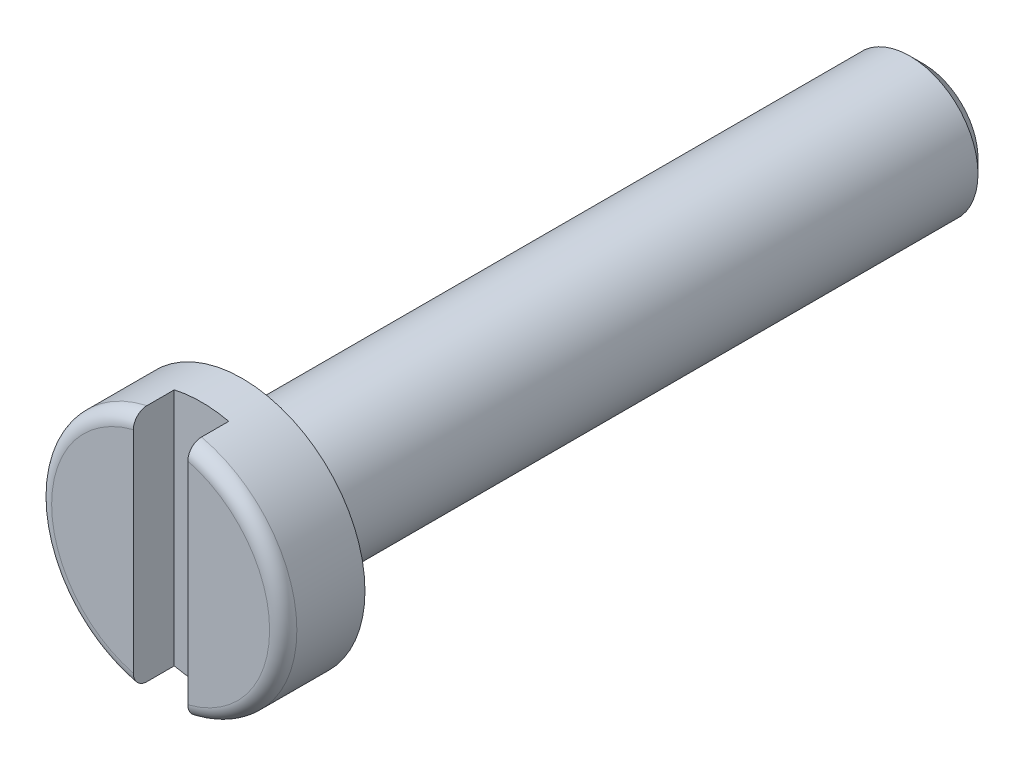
ISO-10303-21;
HEADER;
FILE_DESCRIPTION(('STEP AP214'),'2;1');
FILE_NAME('part.step','',(''),(''),'','','');
FILE_SCHEMA(('AUTOMOTIVE_DESIGN { 1 0 10303 214 1 1 1 1 }'));
ENDSEC;
DATA;
#1=APPLICATION_CONTEXT('core data for automotive mechanical design processes');
#2=APPLICATION_PROTOCOL_DEFINITION('international standard','automotive_design',2000,#1);
#3=PRODUCT_CONTEXT('',#1,'mechanical');
#4=PRODUCT('Part','Part','',(#3));
#5=PRODUCT_RELATED_PRODUCT_CATEGORY('part','',(#4));
#6=PRODUCT_DEFINITION_FORMATION('','',#4);
#7=PRODUCT_DEFINITION_CONTEXT('part definition',#1,'design');
#8=PRODUCT_DEFINITION('design','',#6,#7);
#9=PRODUCT_DEFINITION_SHAPE('','',#8);
#10=(LENGTH_UNIT() NAMED_UNIT(*) SI_UNIT(.MILLI.,.METRE.));
#11=(NAMED_UNIT(*) PLANE_ANGLE_UNIT() SI_UNIT($,.RADIAN.));
#12=(NAMED_UNIT(*) SI_UNIT($,.STERADIAN.) SOLID_ANGLE_UNIT());
#13=UNCERTAINTY_MEASURE_WITH_UNIT(LENGTH_MEASURE(1.E-05),#10,'distance_accuracy_value','');
#14=(GEOMETRIC_REPRESENTATION_CONTEXT(3) GLOBAL_UNCERTAINTY_ASSIGNED_CONTEXT((#13)) GLOBAL_UNIT_ASSIGNED_CONTEXT((#10,
#11,#12)) REPRESENTATION_CONTEXT('',''));
#15=CARTESIAN_POINT('',(0.,0.,0.));
#16=DIRECTION('',(0.,0.,1.));
#17=DIRECTION('',(1.,0.,0.));
#18=AXIS2_PLACEMENT_3D('',#15,#16,#17);
#19=CARTESIAN_POINT('',(0.,0.,3.));
#20=DIRECTION('',(0.,0.,1.));
#21=DIRECTION('',(1.,0.,0.));
#22=AXIS2_PLACEMENT_3D('',#19,#20,#21);
#23=PLANE('',#22);
#24=DIRECTION('',(0.,-1.,0.));
#25=VECTOR('',#24,1.);
#26=CARTESIAN_POINT('',(-1.,4.8446694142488,3.));
#27=LINE('',#26,#25);
#28=CARTESIAN_POINT('',(-1.,3.87298334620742,3.));
#29=VERTEX_POINT('',#28);
#30=CARTESIAN_POINT('',(-1.,-3.87298334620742,3.));
#31=VERTEX_POINT('',#30);
#32=EDGE_CURVE('E88',#29,#31,#27,.T.);
#33=ORIENTED_EDGE('',*,*,#32,.F.);
#34=CARTESIAN_POINT('',(0.,0.,3.));
#35=DIRECTION('',(0.,0.,1.));
#36=DIRECTION('',(1.,0.,0.));
#37=AXIS2_PLACEMENT_3D('',#34,#35,#36);
#38=CIRCLE('',#37,4.);
#39=EDGE_CURVE('E99',#29,#31,#38,.T.);
#40=ORIENTED_EDGE('',*,*,#39,.T.);
#41=EDGE_LOOP('',(#33,#40));
#42=FACE_BOUND('',#41,.T.);
#43=ADVANCED_FACE('F33',(#42),#23,.T.);
#44=CARTESIAN_POINT('',(0.,0.,2.5));
#45=DIRECTION('',(0.,0.,1.));
#46=DIRECTION('',(1.,0.,0.));
#47=AXIS2_PLACEMENT_3D('',#44,#45,#46);
#48=TOROIDAL_SURFACE('',#47,4.,0.5);
#49=CARTESIAN_POINT('',(-0.999999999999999,-4.32830289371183,2.73313755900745));
#50=CARTESIAN_POINT('',(-0.999999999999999,-4.34139692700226,2.70893011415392));
#51=CARTESIAN_POINT('',(-0.999999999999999,-4.35247607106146,2.68361258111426));
#52=CARTESIAN_POINT('',(-0.999999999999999,-4.37024206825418,2.63145979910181));
#53=CARTESIAN_POINT('',(-0.999999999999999,-4.3769246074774,2.60462308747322));
#54=CARTESIAN_POINT('',(-0.999999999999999,-4.38567140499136,2.55020578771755));
#55=CARTESIAN_POINT('',(-0.999999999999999,-4.38773592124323,2.52262524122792));
#56=CARTESIAN_POINT('',(-0.999999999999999,-4.38717864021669,2.46751789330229));
#57=CARTESIAN_POINT('',(-0.999999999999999,-4.38455784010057,2.43999108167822));
#58=CARTESIAN_POINT('',(-0.999999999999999,-4.37474078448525,2.3859011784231));
#59=CARTESIAN_POINT('',(-0.999999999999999,-4.3675661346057,2.35933415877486));
#60=CARTESIAN_POINT('',(-0.999999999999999,-4.34888894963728,2.30776860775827));
#61=CARTESIAN_POINT('',(-0.999999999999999,-4.33738623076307,2.282770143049));
#62=CARTESIAN_POINT('',(-0.999999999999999,-4.31031223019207,2.23484839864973));
#63=CARTESIAN_POINT('',(-0.999999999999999,-4.29471242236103,2.21194124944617));
#64=CARTESIAN_POINT('',(-0.999999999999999,-4.25995757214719,2.16900704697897));
#65=CARTESIAN_POINT('',(-1.,-4.2408022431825,2.14898022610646));
#66=CARTESIAN_POINT('',(-1.,-4.19908637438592,2.11194360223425));
#67=CARTESIAN_POINT('',(-1.,-4.17646615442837,2.09500105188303));
#68=CARTESIAN_POINT('',(-1.,-4.12876331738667,2.06503880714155));
#69=CARTESIAN_POINT('',(-1.,-4.10368039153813,2.05201960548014));
#70=CARTESIAN_POINT('',(-1.,-4.0510522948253,2.02990560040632));
#71=CARTESIAN_POINT('',(-1.,-4.0234593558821,2.02092447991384));
#72=CARTESIAN_POINT('',(-1.,-3.96717619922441,2.00759679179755));
#73=CARTESIAN_POINT('',(-1.,-3.93848582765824,2.00325087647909));
#74=CARTESIAN_POINT('',(-1.,-3.88006131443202,1.9992227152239));
#75=CARTESIAN_POINT('',(-1.,-3.85031895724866,1.99965911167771));
#76=CARTESIAN_POINT('',(-1.,-3.79131568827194,2.00545202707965));
#77=CARTESIAN_POINT('',(-1.,-3.76205482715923,2.01080906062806));
#78=CARTESIAN_POINT('',(-1.,-3.70446791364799,2.02640202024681));
#79=CARTESIAN_POINT('',(-1.,-3.67615807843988,2.03669798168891));
#80=CARTESIAN_POINT('',(-1.,-3.6216883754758,2.06193749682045));
#81=CARTESIAN_POINT('',(-1.,-3.59552850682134,2.07688104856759));
#82=CARTESIAN_POINT('',(-1.,-3.54638519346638,2.11088668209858));
#83=CARTESIAN_POINT('',(-1.,-3.52337509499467,2.12991018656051));
#84=CARTESIAN_POINT('',(-1.,-3.48100222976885,2.17166261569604));
#85=CARTESIAN_POINT('',(-1.,-3.46163884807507,2.19439091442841));
#86=CARTESIAN_POINT('',(-1.,-3.42777949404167,2.24216206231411));
#87=CARTESIAN_POINT('',(-1.,-3.41315046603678,2.26711053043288));
#88=CARTESIAN_POINT('',(-1.,-3.38848721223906,2.31918403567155));
#89=CARTESIAN_POINT('',(-1.,-3.37845177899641,2.34630849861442));
#90=CARTESIAN_POINT('',(-1.,-3.36365879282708,2.40081837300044));
#91=CARTESIAN_POINT('',(-1.,-3.35870984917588,2.42815191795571));
#92=CARTESIAN_POINT('',(-1.,-3.3535965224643,2.4832614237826));
#93=CARTESIAN_POINT('',(-1.,-3.35343132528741,2.51103730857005));
#94=CARTESIAN_POINT('',(-1.,-3.3578362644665,2.56553821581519));
#95=CARTESIAN_POINT('',(-1.,-3.36229324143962,2.59227248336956));
#96=CARTESIAN_POINT('',(-1.,-3.37560749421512,2.64461951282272));
#97=CARTESIAN_POINT('',(-1.,-3.38446478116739,2.67023227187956));
#98=CARTESIAN_POINT('',(-1.,-3.4063391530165,2.71979373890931));
#99=CARTESIAN_POINT('',(-1.,-3.419380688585,2.74373163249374));
#100=CARTESIAN_POINT('',(-1.,-3.44918161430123,2.78916638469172));
#101=CARTESIAN_POINT('',(-1.,-3.46594149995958,2.81066291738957));
#102=CARTESIAN_POINT('',(-1.,-3.50324655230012,2.85132881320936));
#103=CARTESIAN_POINT('',(-1.,-3.52389325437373,2.87040497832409));
#104=CARTESIAN_POINT('',(-1.,-3.56799383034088,2.90497477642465));
#105=CARTESIAN_POINT('',(-1.,-3.59144823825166,2.92046772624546));
#106=CARTESIAN_POINT('',(-1.,-3.64145927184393,2.94804315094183));
#107=CARTESIAN_POINT('',(-1.,-3.66810009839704,2.95997301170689));
#108=CARTESIAN_POINT('',(-1.,-3.72297295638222,2.97932213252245));
#109=CARTESIAN_POINT('',(-1.,-3.75120523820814,2.98674068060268));
#110=CARTESIAN_POINT('',(-1.,-3.80925458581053,2.99702144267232));
#111=CARTESIAN_POINT('',(-1.,-3.83909379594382,2.99975905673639));
#112=CARTESIAN_POINT('',(-1.,-3.89881097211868,3.00021047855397));
#113=CARTESIAN_POINT('',(-1.,-3.92868893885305,2.99792419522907));
#114=CARTESIAN_POINT('',(-1.,-3.9877578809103,2.98833959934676));
#115=CARTESIAN_POINT('',(-1.,-4.01694556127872,2.98102090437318));
#116=CARTESIAN_POINT('',(-1.,-4.0736528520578,2.96150482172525));
#117=CARTESIAN_POINT('',(-1.,-4.10117215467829,2.94930653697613));
#118=CARTESIAN_POINT('',(-1.,-4.15327407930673,2.92056157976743));
#119=CARTESIAN_POINT('',(-1.,-4.17789596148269,2.90408604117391));
#120=CARTESIAN_POINT('',(-1.,-4.22390116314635,2.86713988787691));
#121=CARTESIAN_POINT('',(-1.,-4.24528888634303,2.84667479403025));
#122=CARTESIAN_POINT('',(-1.,-4.27696773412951,2.81052652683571));
#123=CARTESIAN_POINT('',(-0.999999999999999,-4.28844231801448,2.79586319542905));
#124=CARTESIAN_POINT('',(-0.999999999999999,-4.30968558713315,2.76534805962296));
#125=CARTESIAN_POINT('',(-0.999999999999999,-4.31945430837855,2.74949628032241));
#126=CARTESIAN_POINT('',(-0.999999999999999,-4.32830289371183,2.73313755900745));
#127=B_SPLINE_CURVE_WITH_KNOTS('',3,(#49,#50,#51,#52,#53,#54,#55,#56,#57,#58,#59,#60,#61,#62,
#63,#64,#65,#66,#67,#68,#69,#70,#71,#72,#73,#74,#75,#76,#77,#78,#79,#80,#81,#82,#83,#84,#85,#86,
#87,#88,#89,#90,#91,#92,#93,#94,#95,#96,#97,#98,#99,#100,#101,#102,#103,#104,#105,#106,#107,
#108,#109,#110,#111,#112,#113,#114,#115,#116,#117,#118,#119,#120,#121,#122,#123,#124,#125,#126),
.UNSPECIFIED.,.T.,.F.,(4,2,2,2,2,2,2,2,2,2,2,2,2,2,2,2,2,2,2,2,2,2,2,2,2,2,2,2,2,2,2,2,2,2,2,2,
2,2,4),(0.,0.0824988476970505,0.165078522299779,0.247653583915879,0.330211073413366,
0.41237976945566,0.494551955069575,0.577312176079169,0.660079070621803,0.744477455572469,
0.828886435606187,0.915542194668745,1.00221014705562,1.09103297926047,1.17986510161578,
1.26980549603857,1.35974585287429,1.44887059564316,1.53798029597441,1.62430876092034,
1.71061452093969,1.79353865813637,1.87644868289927,1.95737576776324,2.03830305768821,
2.11971213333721,2.20113206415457,2.28508485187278,2.36905363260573,2.45622501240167,
2.54341014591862,2.63288184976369,2.72235517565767,2.81219304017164,2.90204742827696,
2.99049381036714,3.07881865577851,3.13457027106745,3.1903207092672),.UNSPECIFIED.);
#128=CARTESIAN_POINT('',(-0.999999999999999,-4.38748219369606,2.5));
#129=VERTEX_POINT('',#128);
#130=EDGE_CURVE('E57',#31,#129,#127,.T.);
#131=ORIENTED_EDGE('',*,*,#130,.F.);
#132=ORIENTED_EDGE('',*,*,#39,.F.);
#133=CARTESIAN_POINT('',(-1.,3.39057443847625,2.6836974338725));
#134=CARTESIAN_POINT('',(-1.,3.38026979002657,2.65867363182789));
#135=CARTESIAN_POINT('',(-1.,3.37204228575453,2.63277673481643));
#136=CARTESIAN_POINT('',(-1.,3.36004261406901,2.57995244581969));
#137=CARTESIAN_POINT('',(-1.,3.35627419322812,2.55302420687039));
#138=CARTESIAN_POINT('',(-1.,3.35333822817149,2.49891568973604));
#139=CARTESIAN_POINT('',(-1.,3.35417065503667,2.47173541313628));
#140=CARTESIAN_POINT('',(-1.,3.36040633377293,2.41791079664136));
#141=CARTESIAN_POINT('',(-1.,3.3658088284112,2.39126636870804));
#142=CARTESIAN_POINT('',(-1.,3.38096424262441,2.33933942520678));
#143=CARTESIAN_POINT('',(-1.,3.39070342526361,2.31405288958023));
#144=CARTESIAN_POINT('',(-1.,3.41419683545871,2.26542149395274));
#145=CARTESIAN_POINT('',(-1.,3.42795151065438,2.24207685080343));
#146=CARTESIAN_POINT('',(-1.,3.45939431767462,2.19740597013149));
#147=CARTESIAN_POINT('',(-1.,3.47716497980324,2.17613788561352));
#148=CARTESIAN_POINT('',(-1.,3.51590595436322,2.13675097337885));
#149=CARTESIAN_POINT('',(-1.,3.53687683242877,2.11863270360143));
#150=CARTESIAN_POINT('',(-1.,3.5822709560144,2.08533440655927));
#151=CARTESIAN_POINT('',(-1.,3.60679482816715,2.07029154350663));
#152=CARTESIAN_POINT('',(-1.,3.65795801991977,2.04438352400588));
#153=CARTESIAN_POINT('',(-1.,3.6845977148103,2.03351911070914));
#154=CARTESIAN_POINT('',(-1.,3.74017639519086,2.01593129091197));
#155=CARTESIAN_POINT('',(-1.,3.76916213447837,2.00935537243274));
#156=CARTESIAN_POINT('',(-1.,3.82782363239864,2.00109050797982));
#157=CARTESIAN_POINT('',(-1.,3.85749946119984,1.99940206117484));
#158=CARTESIAN_POINT('',(-1.,3.91711850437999,2.00098282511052));
#159=CARTESIAN_POINT('',(-1.,3.94705999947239,2.00431852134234));
#160=CARTESIAN_POINT('',(-1.,4.00594728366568,2.01601429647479));
#161=CARTESIAN_POINT('',(-1.,4.0348930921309,2.02437427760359));
#162=CARTESIAN_POINT('',(-1.,4.0906765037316,2.04583436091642));
#163=CARTESIAN_POINT('',(-1.,4.11753063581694,2.05889143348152));
#164=CARTESIAN_POINT('',(-1.,4.1685913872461,2.08943513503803));
#165=CARTESIAN_POINT('',(-1.,4.19279832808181,2.10692122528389));
#166=CARTESIAN_POINT('',(-1.,4.23724813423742,2.14538622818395));
#167=CARTESIAN_POINT('',(-1.,4.25757209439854,2.16627139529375));
#168=CARTESIAN_POINT('',(-1.,4.29430425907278,2.21124139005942));
#169=CARTESIAN_POINT('',(-1.,4.31071309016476,2.23532570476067));
#170=CARTESIAN_POINT('',(-1.,4.33867606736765,2.28529560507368));
#171=CARTESIAN_POINT('',(-1.,4.35035127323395,2.31111346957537));
#172=CARTESIAN_POINT('',(-1.,4.36909650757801,2.36437002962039));
#173=CARTESIAN_POINT('',(-1.,4.37616714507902,2.3918085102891));
#174=CARTESIAN_POINT('',(-1.,4.38537028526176,2.44691397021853));
#175=CARTESIAN_POINT('',(-1.,4.38760230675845,2.47456436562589));
#176=CARTESIAN_POINT('',(-1.,4.38735211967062,2.52984287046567));
#177=CARTESIAN_POINT('',(-1.,4.38487021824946,2.5574709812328));
#178=CARTESIAN_POINT('',(-1.,4.37531136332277,2.61169602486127));
#179=CARTESIAN_POINT('',(-1.,4.36827043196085,2.63829932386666));
#180=CARTESIAN_POINT('',(-1.,4.34985203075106,2.68995820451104));
#181=CARTESIAN_POINT('',(-1.,4.33847450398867,2.71501376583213));
#182=CARTESIAN_POINT('',(-1.,4.31164215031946,2.76306441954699));
#183=CARTESIAN_POINT('',(-1.,4.29615952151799,2.7860439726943));
#184=CARTESIAN_POINT('',(-1.,4.26162497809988,2.82914076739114));
#185=CARTESIAN_POINT('',(-1.,4.24257277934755,2.84925778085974));
#186=CARTESIAN_POINT('',(-1.,4.20105169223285,2.88648866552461));
#187=CARTESIAN_POINT('',(-1.,4.17852327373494,2.90353611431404));
#188=CARTESIAN_POINT('',(-1.,4.13098548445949,2.93372158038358));
#189=CARTESIAN_POINT('',(-1.,4.10597579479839,2.94685909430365));
#190=CARTESIAN_POINT('',(-1.,4.05347705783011,2.96922263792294));
#191=CARTESIAN_POINT('',(-1.,4.02593979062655,2.97833546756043));
#192=CARTESIAN_POINT('',(-1.,3.9697457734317,2.99193437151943));
#193=CARTESIAN_POINT('',(-1.,3.94108886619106,2.99641979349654));
#194=CARTESIAN_POINT('',(-1.,3.8827052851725,3.00073536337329));
#195=CARTESIAN_POINT('',(-1.,3.85296977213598,3.00044640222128));
#196=CARTESIAN_POINT('',(-1.,3.79395653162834,2.99494874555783));
#197=CARTESIAN_POINT('',(-1.,3.76467883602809,2.98973970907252));
#198=CARTESIAN_POINT('',(-1.,3.70702842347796,2.97444095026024));
#199=CARTESIAN_POINT('',(-1.,3.67867181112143,2.96429040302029));
#200=CARTESIAN_POINT('',(-1.,3.62407616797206,2.9393301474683));
#201=CARTESIAN_POINT('',(-1.,3.5978376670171,2.92451927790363));
#202=CARTESIAN_POINT('',(-1.,3.54849522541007,2.89075244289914));
#203=CARTESIAN_POINT('',(-1.,3.5253672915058,2.87183155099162));
#204=CARTESIAN_POINT('',(-1.,3.48276511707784,2.83027666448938));
#205=CARTESIAN_POINT('',(-1.,3.46328580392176,2.80764790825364));
#206=CARTESIAN_POINT('',(-1.,3.43486077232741,2.76799179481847));
#207=CARTESIAN_POINT('',(-1.,3.42464153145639,2.75186230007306));
#208=CARTESIAN_POINT('',(-1.,3.40612921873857,2.7185321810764));
#209=CARTESIAN_POINT('',(-1.,3.39783607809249,2.70133159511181));
#210=CARTESIAN_POINT('',(-1.,3.39057443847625,2.6836974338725));
#211=B_SPLINE_CURVE_WITH_KNOTS('',3,(#133,#134,#135,#136,#137,#138,#139,#140,#141,#142,#143,
#144,#145,#146,#147,#148,#149,#150,#151,#152,#153,#154,#155,#156,#157,#158,#159,#160,#161,#162,
#163,#164,#165,#166,#167,#168,#169,#170,#171,#172,#173,#174,#175,#176,#177,#178,#179,#180,#181,
#182,#183,#184,#185,#186,#187,#188,#189,#190,#191,#192,#193,#194,#195,#196,#197,#198,#199,#200,
#201,#202,#203,#204,#205,#206,#207,#208,#209,#210),.UNSPECIFIED.,.T.,.F.,(4,2,2,2,2,2,2,2,2,2,2,
2,2,2,2,2,2,2,2,2,2,2,2,2,2,2,2,2,2,2,2,2,2,2,2,2,2,2,4),(0.,0.0811193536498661,
0.162306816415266,0.243493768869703,0.324667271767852,0.405585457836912,0.486512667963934,
0.569284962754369,0.6520719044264,0.737992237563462,0.823927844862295,0.912681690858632,
1.00144460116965,1.09139249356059,1.18133863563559,1.27048093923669,1.35961240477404,
1.44660788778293,1.53358943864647,1.61817976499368,1.70275890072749,1.78558125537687,
1.86839821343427,1.95056866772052,2.03274020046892,2.11548312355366,2.19823263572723,
2.28260038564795,2.36697899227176,2.45359948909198,2.54023219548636,2.62902936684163,
2.71783269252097,2.80775784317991,2.89770541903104,2.98691362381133,3.07599686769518,
3.1331633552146,3.19032780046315),.UNSPECIFIED.);
#212=CARTESIAN_POINT('',(-1.,4.38748219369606,2.5));
#213=VERTEX_POINT('',#212);
#214=EDGE_CURVE('E84',#213,#29,#211,.T.);
#215=ORIENTED_EDGE('',*,*,#214,.F.);
#216=CARTESIAN_POINT('',(0.,0.,2.5));
#217=DIRECTION('',(0.,0.,1.));
#218=DIRECTION('',(1.,0.,0.));
#219=AXIS2_PLACEMENT_3D('',#216,#217,#218);
#220=CIRCLE('',#219,4.5);
#221=EDGE_CURVE('E106',#129,#213,#220,.F.);
#222=ORIENTED_EDGE('',*,*,#221,.F.);
#223=EDGE_LOOP('',(#131,#132,#215,#222));
#224=FACE_BOUND('',#223,.T.);
#225=ADVANCED_FACE('F101',(#224),#48,.T.);
#226=CARTESIAN_POINT('',(0.,0.,0.));
#227=DIRECTION('',(0.,0.,1.));
#228=DIRECTION('',(1.,0.,0.));
#229=AXIS2_PLACEMENT_3D('',#226,#227,#228);
#230=PLANE('',#229);
#231=CARTESIAN_POINT('',(0.,0.,0.));
#232=DIRECTION('',(0.,0.,1.));
#233=DIRECTION('',(1.,0.,0.));
#234=AXIS2_PLACEMENT_3D('',#231,#232,#233);
#235=CIRCLE('',#234,4.5);
#236=CARTESIAN_POINT('',(4.5,0.,0.));
#237=VERTEX_POINT('',#236);
#238=EDGE_CURVE('E162',#237,#237,#235,.T.);
#239=ORIENTED_EDGE('',*,*,#238,.F.);
#240=EDGE_LOOP('',(#239));
#241=FACE_BOUND('',#240,.T.);
#242=CARTESIAN_POINT('',(0.,0.,0.));
#243=DIRECTION('',(0.,0.,1.));
#244=DIRECTION('',(1.,0.,0.));
#245=AXIS2_PLACEMENT_3D('',#242,#243,#244);
#246=CIRCLE('',#245,2.5);
#247=CARTESIAN_POINT('',(2.5,0.,0.));
#248=VERTEX_POINT('',#247);
#249=EDGE_CURVE('E165',#248,#248,#246,.F.);
#250=ORIENTED_EDGE('',*,*,#249,.F.);
#251=EDGE_LOOP('',(#250));
#252=FACE_BOUND('',#251,.T.);
#253=ADVANCED_FACE('F192',(#241,#252),#230,.F.);
#254=CARTESIAN_POINT('',(0.,0.,3.));
#255=DIRECTION('',(0.,0.,-1.));
#256=DIRECTION('',(-1.,0.,0.));
#257=AXIS2_PLACEMENT_3D('',#254,#255,#256);
#258=CYLINDRICAL_SURFACE('',#257,4.5);
#259=ORIENTED_EDGE('',*,*,#221,.T.);
#260=DIRECTION('',(0.,0.,-1.));
#261=VECTOR('',#260,1.);
#262=CARTESIAN_POINT('',(-1.,4.38748219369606,3.));
#263=LINE('',#262,#261);
#264=CARTESIAN_POINT('',(-1.,4.38748219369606,1.5));
#265=VERTEX_POINT('',#264);
#266=EDGE_CURVE('E90',#213,#265,#263,.T.);
#267=ORIENTED_EDGE('',*,*,#266,.T.);
#268=CARTESIAN_POINT('',(0.,0.,1.5));
#269=DIRECTION('',(0.,0.,1.));
#270=DIRECTION('',(1.,0.,0.));
#271=AXIS2_PLACEMENT_3D('',#268,#269,#270);
#272=CIRCLE('',#271,4.5);
#273=CARTESIAN_POINT('',(0.999999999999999,4.38748219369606,1.5));
#274=VERTEX_POINT('',#273);
#275=EDGE_CURVE('E11',#274,#265,#272,.T.);
#276=ORIENTED_EDGE('',*,*,#275,.F.);
#277=DIRECTION('',(0.,0.,-1.));
#278=VECTOR('',#277,1.);
#279=CARTESIAN_POINT('',(0.999999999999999,4.38748219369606,3.));
#280=LINE('',#279,#278);
#281=CARTESIAN_POINT('',(0.999999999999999,4.38748219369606,2.5));
#282=VERTEX_POINT('',#281);
#283=EDGE_CURVE('E150',#274,#282,#280,.F.);
#284=ORIENTED_EDGE('',*,*,#283,.T.);
#285=CARTESIAN_POINT('',(1.,-4.38748219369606,2.5));
#286=VERTEX_POINT('',#285);
#287=EDGE_CURVE('E102',#282,#286,#220,.F.);
#288=ORIENTED_EDGE('',*,*,#287,.T.);
#289=DIRECTION('',(0.,0.,-1.));
#290=VECTOR('',#289,1.);
#291=CARTESIAN_POINT('',(1.,-4.38748219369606,3.));
#292=LINE('',#291,#290);
#293=CARTESIAN_POINT('',(1.,-4.38748219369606,1.5));
#294=VERTEX_POINT('',#293);
#295=EDGE_CURVE('E147',#286,#294,#292,.T.);
#296=ORIENTED_EDGE('',*,*,#295,.T.);
#297=CARTESIAN_POINT('',(-0.999999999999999,-4.38748219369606,1.5));
#298=VERTEX_POINT('',#297);
#299=EDGE_CURVE('E38',#298,#294,#272,.T.);
#300=ORIENTED_EDGE('',*,*,#299,.F.);
#301=DIRECTION('',(0.,0.,-1.));
#302=VECTOR('',#301,1.);
#303=CARTESIAN_POINT('',(-0.999999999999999,-4.38748219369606,3.));
#304=LINE('',#303,#302);
#305=EDGE_CURVE('E156',#298,#129,#304,.F.);
#306=ORIENTED_EDGE('',*,*,#305,.T.);
#307=EDGE_LOOP('',(#259,#267,#276,#284,#288,#296,#300,#306));
#308=FACE_BOUND('',#307,.T.);
#309=ORIENTED_EDGE('',*,*,#238,.T.);
#310=EDGE_LOOP('',(#309));
#311=FACE_BOUND('',#310,.T.);
#312=ADVANCED_FACE('F152',(#308,#311),#258,.T.);
#313=DIRECTION('',(0.,1.,0.));
#314=VECTOR('',#313,1.);
#315=CARTESIAN_POINT('',(0.999999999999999,4.8446694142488,3.));
#316=LINE('',#315,#314);
#317=CARTESIAN_POINT('',(1.,-3.87298334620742,3.));
#318=VERTEX_POINT('',#317);
#319=CARTESIAN_POINT('',(0.999999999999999,3.87298334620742,3.));
#320=VERTEX_POINT('',#319);
#321=EDGE_CURVE('E49',#318,#320,#316,.T.);
#322=ORIENTED_EDGE('',*,*,#321,.F.);
#323=EDGE_CURVE('E103',#318,#320,#38,.T.);
#324=ORIENTED_EDGE('',*,*,#323,.T.);
#325=EDGE_LOOP('',(#322,#324));
#326=FACE_BOUND('',#325,.T.);
#327=ADVANCED_FACE('F188',(#326),#23,.T.);
#328=CARTESIAN_POINT('',(0.,0.,-25.));
#329=DIRECTION('',(0.,0.,1.));
#330=DIRECTION('',(1.,0.,0.));
#331=AXIS2_PLACEMENT_3D('',#328,#329,#330);
#332=CYLINDRICAL_SURFACE('',#331,2.5);
#333=CARTESIAN_POINT('',(0.,0.,-24.5));
#334=DIRECTION('',(0.,0.,-1.));
#335=DIRECTION('',(-1.,0.,0.));
#336=AXIS2_PLACEMENT_3D('',#333,#334,#335);
#337=CIRCLE('',#336,2.5);
#338=CARTESIAN_POINT('',(-2.5,0.,-24.5));
#339=VERTEX_POINT('',#338);
#340=EDGE_CURVE('E109',#339,#339,#337,.F.);
#341=ORIENTED_EDGE('',*,*,#340,.T.);
#342=EDGE_LOOP('',(#341));
#343=FACE_BOUND('',#342,.T.);
#344=ORIENTED_EDGE('',*,*,#249,.T.);
#345=EDGE_LOOP('',(#344));
#346=FACE_BOUND('',#345,.T.);
#347=ADVANCED_FACE('F174',(#343,#346),#332,.T.);
#348=CARTESIAN_POINT('',(0.,0.,-25.));
#349=DIRECTION('',(0.,0.,-1.));
#350=DIRECTION('',(-1.,0.,0.));
#351=AXIS2_PLACEMENT_3D('',#348,#349,#350);
#352=PLANE('',#351);
#353=CARTESIAN_POINT('',(0.,0.,-25.));
#354=DIRECTION('',(0.,0.,-1.));
#355=DIRECTION('',(-1.,0.,0.));
#356=AXIS2_PLACEMENT_3D('',#353,#354,#355);
#357=CIRCLE('',#356,2.);
#358=CARTESIAN_POINT('',(-2.,0.,-25.));
#359=VERTEX_POINT('',#358);
#360=EDGE_CURVE('E167',#359,#359,#357,.T.);
#361=ORIENTED_EDGE('',*,*,#360,.T.);
#362=EDGE_LOOP('',(#361));
#363=FACE_BOUND('',#362,.T.);
#364=ADVANCED_FACE('F130',(#363),#352,.T.);
#365=CARTESIAN_POINT('',(0.,0.,-25.));
#366=DIRECTION('',(0.,0.,1.));
#367=DIRECTION('',(1.,0.,0.));
#368=AXIS2_PLACEMENT_3D('',#365,#366,#367);
#369=CONICAL_SURFACE('',#368,2.,0.785398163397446);
#370=ORIENTED_EDGE('',*,*,#340,.F.);
#371=EDGE_LOOP('',(#370));
#372=FACE_BOUND('',#371,.T.);
#373=ORIENTED_EDGE('',*,*,#360,.F.);
#374=EDGE_LOOP('',(#373));
#375=FACE_BOUND('',#374,.T.);
#376=ADVANCED_FACE('F177',(#372,#375),#369,.T.);
#377=CARTESIAN_POINT('',(1.,-4.32830289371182,2.73313755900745));
#378=CARTESIAN_POINT('',(1.,-4.31482198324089,2.75805470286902));
#379=CARTESIAN_POINT('',(1.,-4.29918542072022,2.78183265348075));
#380=CARTESIAN_POINT('',(1.,-4.26410188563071,2.82642259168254));
#381=CARTESIAN_POINT('',(1.,-4.24464933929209,2.84723016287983));
#382=CARTESIAN_POINT('',(1.,-4.20257677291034,2.8852745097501));
#383=CARTESIAN_POINT('',(1.,-4.17996183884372,2.9025169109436));
#384=CARTESIAN_POINT('',(1.,-4.13221425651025,2.93304137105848));
#385=CARTESIAN_POINT('',(1.,-4.10708222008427,2.94632438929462));
#386=CARTESIAN_POINT('',(1.,-4.05447621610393,2.96885932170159));
#387=CARTESIAN_POINT('',(1.,-4.02696548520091,2.97802537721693));
#388=CARTESIAN_POINT('',(1.,-3.97081426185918,2.99173543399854));
#389=CARTESIAN_POINT('',(1.,-3.9421735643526,2.99627859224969));
#390=CARTESIAN_POINT('',(1.,-3.88381029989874,3.00071392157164));
#391=CARTESIAN_POINT('',(1.,-3.85407861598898,3.00048657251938));
#392=CARTESIAN_POINT('',(1.,-3.79506164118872,2.99511251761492));
#393=CARTESIAN_POINT('',(1.,-3.76577639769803,2.98996529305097));
#394=CARTESIAN_POINT('',(1.,-3.70809397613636,2.97478777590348));
#395=CARTESIAN_POINT('',(1.,-3.67971304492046,2.96469558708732));
#396=CARTESIAN_POINT('',(1.,-3.62506638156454,2.93985111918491));
#397=CARTESIAN_POINT('',(1.,-3.59880064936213,2.92509884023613));
#398=CARTESIAN_POINT('',(1.,-3.54940022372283,2.8914476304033));
#399=CARTESIAN_POINT('',(1.,-3.52624065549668,2.87258527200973));
#400=CARTESIAN_POINT('',(1.,-3.48354141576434,2.83112816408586));
#401=CARTESIAN_POINT('',(1.,-3.46400115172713,2.80853402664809));
#402=CARTESIAN_POINT('',(1.,-3.42976429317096,2.76098614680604));
#403=CARTESIAN_POINT('',(1.,-3.41493692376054,2.7361266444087));
#404=CARTESIAN_POINT('',(1.,-3.38986474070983,2.6841948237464));
#405=CARTESIAN_POINT('',(1.,-3.37961872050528,2.6571230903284));
#406=CARTESIAN_POINT('',(1.,-3.36440898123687,2.60268059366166));
#407=CARTESIAN_POINT('',(1.,-3.35925371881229,2.5753632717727));
#408=CARTESIAN_POINT('',(1.,-3.35373083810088,2.5202503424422));
#409=CARTESIAN_POINT('',(1.,-3.35336239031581,2.49245481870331));
#410=CARTESIAN_POINT('',(1.,-3.3573753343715,2.4378963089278));
#411=CARTESIAN_POINT('',(1.,-3.36164079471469,2.41112469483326));
#412=CARTESIAN_POINT('',(1.,-3.37458394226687,2.35867254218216));
#413=CARTESIAN_POINT('',(1.,-3.38326162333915,2.33299200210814));
#414=CARTESIAN_POINT('',(1.,-3.4047859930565,2.28328400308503));
#415=CARTESIAN_POINT('',(1.,-3.41765453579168,2.25926602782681));
#416=CARTESIAN_POINT('',(1.,-3.4471262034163,2.21364510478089));
#417=CARTESIAN_POINT('',(1.,-3.46372982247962,2.19204247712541));
#418=CARTESIAN_POINT('',(1.,-3.50073112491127,2.15114594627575));
#419=CARTESIAN_POINT('',(1.,-3.52122974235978,2.131943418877));
#420=CARTESIAN_POINT('',(1.,-3.56505627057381,2.09709849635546));
#421=CARTESIAN_POINT('',(1.,-3.58838471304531,2.0814567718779));
#422=CARTESIAN_POINT('',(1.,-3.63816589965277,2.05355775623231));
#423=CARTESIAN_POINT('',(1.,-3.66470396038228,2.04145260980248));
#424=CARTESIAN_POINT('',(1.,-3.71940072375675,2.0217366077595));
#425=CARTESIAN_POINT('',(1.,-3.74755968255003,2.0141264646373));
#426=CARTESIAN_POINT('',(1.,-3.80550359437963,2.00344281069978));
#427=CARTESIAN_POINT('',(1.,-3.8353118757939,2.00049540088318));
#428=CARTESIAN_POINT('',(1.,-3.8950038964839,1.99961941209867));
#429=CARTESIAN_POINT('',(1.,-3.92488763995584,2.0016911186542));
#430=CARTESIAN_POINT('',(1.,-3.98402275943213,2.01084917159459));
#431=CARTESIAN_POINT('',(1.,-4.01327053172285,2.0179588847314));
#432=CARTESIAN_POINT('',(1.,-4.07012584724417,2.03706598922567));
#433=CARTESIAN_POINT('',(1.,-4.09773349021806,2.04906308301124));
#434=CARTESIAN_POINT('',(1.,-4.1500436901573,2.07742511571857));
#435=CARTESIAN_POINT('',(1.,-4.17478526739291,2.09371801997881));
#436=CARTESIAN_POINT('',(1.,-4.22108435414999,2.13033265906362));
#437=CARTESIAN_POINT('',(1.,-4.24264231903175,2.1506538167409));
#438=CARTESIAN_POINT('',(1.,-4.28134491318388,2.19416929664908));
#439=CARTESIAN_POINT('',(1.,-4.29859183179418,2.2172726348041));
#440=CARTESIAN_POINT('',(1.,-4.32883870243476,2.26610896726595));
#441=CARTESIAN_POINT('',(1.,-4.34183949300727,2.29184144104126));
#442=CARTESIAN_POINT('',(1.,-4.36287998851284,2.34448086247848));
#443=CARTESIAN_POINT('',(1.,-4.37104028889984,2.37133964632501));
#444=CARTESIAN_POINT('',(1.,-4.3826533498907,2.42606407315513));
#445=CARTESIAN_POINT('',(1.,-4.38610538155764,2.4539298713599));
#446=CARTESIAN_POINT('',(1.,-4.38816896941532,2.50939191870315));
#447=CARTESIAN_POINT('',(1.,-4.38685657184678,2.53698541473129));
#448=CARTESIAN_POINT('',(1.,-4.37960226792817,2.59153146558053));
#449=CARTESIAN_POINT('',(1.,-4.37366643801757,2.6184848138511));
#450=CARTESIAN_POINT('',(1.,-4.36078005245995,2.6600290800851));
#451=CARTESIAN_POINT('',(1.,-4.35528532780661,2.67508736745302));
#452=CARTESIAN_POINT('',(1.,-4.34285771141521,2.70459766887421));
#453=CARTESIAN_POINT('',(1.,-4.33592484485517,2.71904969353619));
#454=CARTESIAN_POINT('',(1.,-4.32830289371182,2.73313755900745));
#455=B_SPLINE_CURVE_WITH_KNOTS('',3,(#377,#378,#379,#380,#381,#382,#383,#384,#385,#386,#387,
#388,#389,#390,#391,#392,#393,#394,#395,#396,#397,#398,#399,#400,#401,#402,#403,#404,#405,#406,
#407,#408,#409,#410,#411,#412,#413,#414,#415,#416,#417,#418,#419,#420,#421,#422,#423,#424,#425,
#426,#427,#428,#429,#430,#431,#432,#433,#434,#435,#436,#437,#438,#439,#440,#441,#442,#443,#444,
#445,#446,#447,#448,#449,#450,#451,#452,#453,#454),.UNSPECIFIED.,.T.,.F.,(4,2,2,2,2,2,2,2,2,2,2,
2,2,2,2,2,2,2,2,2,2,2,2,2,2,2,2,2,2,2,2,2,2,2,2,2,2,2,4),(0.,0.0849302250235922,
0.169985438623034,0.254905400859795,0.339804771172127,0.426400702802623,0.513012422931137,
0.601796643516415,0.690590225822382,0.78052478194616,0.870459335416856,0.959624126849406,
1.04877430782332,1.13517556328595,1.22155405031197,1.30454222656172,1.38751602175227,
1.46846078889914,1.54940544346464,1.63077914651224,1.71216362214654,1.79604968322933,
1.87995153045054,1.96705905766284,2.05418038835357,2.14361988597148,2.23306447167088,
2.32292664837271,2.41278335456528,2.50121979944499,2.58964358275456,2.67571128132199,
2.76176197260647,2.84556739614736,2.92938579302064,3.01187226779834,3.09425051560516,
3.14226992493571,3.19028849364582),.UNSPECIFIED.);
#456=EDGE_CURVE('E95',#286,#318,#455,.T.);
#457=ORIENTED_EDGE('',*,*,#456,.F.);
#458=ORIENTED_EDGE('',*,*,#287,.F.);
#459=CARTESIAN_POINT('',(0.999999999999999,3.39057443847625,2.6836974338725));
#460=CARTESIAN_POINT('',(0.999999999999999,3.40133734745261,2.70982698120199));
#461=CARTESIAN_POINT('',(0.999999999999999,3.41438218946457,2.73504364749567));
#462=CARTESIAN_POINT('',(0.999999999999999,3.4445741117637,2.78292115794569));
#463=CARTESIAN_POINT('',(0.999999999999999,3.46172782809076,2.80557777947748));
#464=CARTESIAN_POINT('',(0.999999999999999,3.49952399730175,2.84767535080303));
#465=CARTESIAN_POINT('',(0.999999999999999,3.52015895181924,2.86712303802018));
#466=CARTESIAN_POINT('',(0.999999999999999,3.56431158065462,2.90238834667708));
#467=CARTESIAN_POINT('',(0.999999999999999,3.58782855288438,2.91820684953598));
#468=CARTESIAN_POINT('',(0.999999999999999,3.63780150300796,2.94626306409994));
#469=CARTESIAN_POINT('',(0.999999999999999,3.6643223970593,2.95838515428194));
#470=CARTESIAN_POINT('',(0.999999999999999,3.71898899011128,2.97813933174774));
#471=CARTESIAN_POINT('',(0.999999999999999,3.74713501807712,2.98577050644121));
#472=CARTESIAN_POINT('',(0.999999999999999,3.80506205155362,2.99650078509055));
#473=CARTESIAN_POINT('',(0.999999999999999,3.83486666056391,2.99947288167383));
#474=CARTESIAN_POINT('',(0.999999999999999,3.89455558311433,3.00039882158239));
#475=CARTESIAN_POINT('',(0.999999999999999,3.92443990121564,2.99835237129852));
#476=CARTESIAN_POINT('',(0.999999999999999,3.98358222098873,2.98924463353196));
#477=CARTESIAN_POINT('',(0.999999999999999,4.01283659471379,2.98215968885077));
#478=CARTESIAN_POINT('',(0.999999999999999,4.06970917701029,2.96310088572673));
#479=CARTESIAN_POINT('',(0.999999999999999,4.09732749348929,2.95112735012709));
#480=CARTESIAN_POINT('',(0.999999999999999,4.14966407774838,2.92280949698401));
#481=CARTESIAN_POINT('',(0.999999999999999,4.17442119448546,2.90653704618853));
#482=CARTESIAN_POINT('',(0.999999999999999,4.22075471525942,2.86996037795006));
#483=CARTESIAN_POINT('',(0.999999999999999,4.24233157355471,2.84965673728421));
#484=CARTESIAN_POINT('',(0.999999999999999,4.2810740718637,2.80617246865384));
#485=CARTESIAN_POINT('',(0.999999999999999,4.29834195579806,2.78308294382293));
#486=CARTESIAN_POINT('',(0.999999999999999,4.32863349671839,2.73426948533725));
#487=CARTESIAN_POINT('',(0.999999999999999,4.34165781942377,2.70854596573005));
#488=CARTESIAN_POINT('',(0.999999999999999,4.36274661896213,2.65591721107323));
#489=CARTESIAN_POINT('',(0.999999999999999,4.37093123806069,2.62906008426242));
#490=CARTESIAN_POINT('',(0.999999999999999,4.38259088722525,2.57434271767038));
#491=CARTESIAN_POINT('',(0.999999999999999,4.38606643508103,2.54648258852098));
#492=CARTESIAN_POINT('',(0.999999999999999,4.3881757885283,2.49103968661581));
#493=CARTESIAN_POINT('',(0.999999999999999,4.38688815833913,2.46345987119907));
#494=CARTESIAN_POINT('',(0.999999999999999,4.37968837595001,2.40891183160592));
#495=CARTESIAN_POINT('',(0.999999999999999,4.37377639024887,2.38194358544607));
#496=CARTESIAN_POINT('',(0.999999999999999,4.35753637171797,2.32944092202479));
#497=CARTESIAN_POINT('',(0.999999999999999,4.34721845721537,2.303903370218));
#498=CARTESIAN_POINT('',(0.999999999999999,4.32249111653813,2.25489442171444));
#499=CARTESIAN_POINT('',(0.999999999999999,4.30808152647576,2.23142310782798));
#500=CARTESIAN_POINT('',(0.999999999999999,4.27541035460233,2.18689688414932));
#501=CARTESIAN_POINT('',(0.999999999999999,4.25710427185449,2.16587465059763));
#502=CARTESIAN_POINT('',(0.999999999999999,4.2172941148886,2.12711732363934));
#503=CARTESIAN_POINT('',(0.999999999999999,4.19578971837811,2.10938256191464));
#504=CARTESIAN_POINT('',(0.999999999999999,4.14967111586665,2.07726135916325));
#505=CARTESIAN_POINT('',(0.999999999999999,4.12499676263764,2.06296130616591));
#506=CARTESIAN_POINT('',(0.999999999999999,4.07364563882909,2.03858105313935));
#507=CARTESIAN_POINT('',(0.999999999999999,4.04696859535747,2.02850142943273));
#508=CARTESIAN_POINT('',(0.999999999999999,3.99159648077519,2.01256453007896));
#509=CARTESIAN_POINT('',(0.999999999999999,3.96286629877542,2.00682920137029));
#510=CARTESIAN_POINT('',(0.999999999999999,3.90485390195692,2.00015059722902));
#511=CARTESIAN_POINT('',(0.999999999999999,3.87557161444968,1.99920795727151));
#512=CARTESIAN_POINT('',(0.999999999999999,3.81661176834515,2.00214811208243));
#513=CARTESIAN_POINT('',(0.999999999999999,3.78693940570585,2.00613597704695));
#514=CARTESIAN_POINT('',(0.999999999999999,3.72867325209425,2.01900581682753));
#515=CARTESIAN_POINT('',(0.999999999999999,3.70007954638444,2.02788817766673));
#516=CARTESIAN_POINT('',(0.999999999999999,3.64463235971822,2.05039026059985));
#517=CARTESIAN_POINT('',(0.999999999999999,3.61778941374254,2.06403599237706));
#518=CARTESIAN_POINT('',(0.999999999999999,3.56682816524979,2.09571675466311));
#519=CARTESIAN_POINT('',(0.999999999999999,3.54270970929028,2.11375153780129));
#520=CARTESIAN_POINT('',(0.999999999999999,3.49836914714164,2.15339165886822));
#521=CARTESIAN_POINT('',(0.999999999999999,3.4780858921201,2.17492850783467));
#522=CARTESIAN_POINT('',(0.999999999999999,3.44158888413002,2.2212122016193));
#523=CARTESIAN_POINT('',(0.999999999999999,3.42537406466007,2.24595820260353));
#524=CARTESIAN_POINT('',(0.999999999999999,3.39811766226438,2.29699192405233));
#525=CARTESIAN_POINT('',(0.999999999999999,3.38690856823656,2.32319016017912));
#526=CARTESIAN_POINT('',(0.999999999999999,3.36923460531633,2.37714901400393));
#527=CARTESIAN_POINT('',(0.999999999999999,3.3627698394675,2.40490966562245));
#528=CARTESIAN_POINT('',(0.999999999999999,3.35498107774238,2.46012231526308));
#529=CARTESIAN_POINT('',(0.999999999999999,3.35348111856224,2.48754970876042));
#530=CARTESIAN_POINT('',(0.999999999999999,3.3551856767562,2.54223194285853));
#531=CARTESIAN_POINT('',(0.999999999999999,3.35838353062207,2.56948697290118));
#532=CARTESIAN_POINT('',(0.999999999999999,3.36691946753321,2.61120820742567));
#533=CARTESIAN_POINT('',(0.999999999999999,3.37069120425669,2.62601237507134));
#534=CARTESIAN_POINT('',(0.999999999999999,3.37961148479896,2.65519896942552));
#535=CARTESIAN_POINT('',(0.999999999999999,3.38475996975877,2.66958141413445));
#536=CARTESIAN_POINT('',(0.999999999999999,3.39057443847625,2.6836974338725));
#537=B_SPLINE_CURVE_WITH_KNOTS('',3,(#459,#460,#461,#462,#463,#464,#465,#466,#467,#468,#469,
#470,#471,#472,#473,#474,#475,#476,#477,#478,#479,#480,#481,#482,#483,#484,#485,#486,#487,#488,
#489,#490,#491,#492,#493,#494,#495,#496,#497,#498,#499,#500,#501,#502,#503,#504,#505,#506,#507,
#508,#509,#510,#511,#512,#513,#514,#515,#516,#517,#518,#519,#520,#521,#522,#523,#524,#525,#526,
#527,#528,#529,#530,#531,#532,#533,#534,#535,#536),.UNSPECIFIED.,.T.,.F.,(4,2,2,2,2,2,2,2,2,2,2,
2,2,2,2,2,2,2,2,2,2,2,2,2,2,2,2,2,2,2,2,2,2,2,2,2,2,2,4),(0.,0.0847197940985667,
0.169577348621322,0.254254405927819,0.338910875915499,0.425993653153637,0.51309412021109,
0.60253005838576,0.69197122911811,0.781835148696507,0.871693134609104,0.960134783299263,
1.04856378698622,1.13463590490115,1.22069451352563,1.30451578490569,1.38832783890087,
1.4707637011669,1.55319659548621,1.63544119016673,1.7176890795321,1.80093220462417,
1.88418372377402,1.96934992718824,2.05452775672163,2.14201602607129,2.2295158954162,
2.31891297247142,2.40831710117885,2.49821724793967,2.58811232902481,2.67642395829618,
2.76471241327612,2.84977191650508,2.93483326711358,3.01684561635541,3.09874174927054,
3.1445120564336,3.19028040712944),.UNSPECIFIED.);
#538=EDGE_CURVE('E113',#320,#282,#537,.T.);
#539=ORIENTED_EDGE('',*,*,#538,.F.);
#540=ORIENTED_EDGE('',*,*,#323,.F.);
#541=EDGE_LOOP('',(#457,#458,#539,#540));
#542=FACE_BOUND('',#541,.T.);
#543=ADVANCED_FACE('F35',(#542),#48,.T.);
#544=CARTESIAN_POINT('',(-0.999999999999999,-5.0945702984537,1.5));
#545=DIRECTION('',(0.,0.,1.));
#546=DIRECTION('',(1.,0.,0.));
#547=AXIS2_PLACEMENT_3D('',#544,#545,#546);
#548=PLANE('',#547);
#549=ORIENTED_EDGE('',*,*,#275,.T.);
#550=DIRECTION('',(0.,-1.,0.));
#551=VECTOR('',#550,1.);
#552=CARTESIAN_POINT('',(-1.,4.8446694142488,1.5));
#553=LINE('',#552,#551);
#554=EDGE_CURVE('E144',#265,#298,#553,.T.);
#555=ORIENTED_EDGE('',*,*,#554,.T.);
#556=ORIENTED_EDGE('',*,*,#299,.T.);
#557=DIRECTION('',(0.,1.,0.));
#558=VECTOR('',#557,1.);
#559=CARTESIAN_POINT('',(0.999999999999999,4.8446694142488,1.5));
#560=LINE('',#559,#558);
#561=EDGE_CURVE('E142',#294,#274,#560,.T.);
#562=ORIENTED_EDGE('',*,*,#561,.T.);
#563=EDGE_LOOP('',(#549,#555,#556,#562));
#564=FACE_BOUND('',#563,.T.);
#565=ADVANCED_FACE('F125',(#564),#548,.T.);
#566=CARTESIAN_POINT('',(-1.,4.8446694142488,1.5));
#567=DIRECTION('',(-1.,0.,0.));
#568=DIRECTION('',(0.,-1.,0.));
#569=AXIS2_PLACEMENT_3D('',#566,#567,#568);
#570=PLANE('',#569);
#571=ORIENTED_EDGE('',*,*,#554,.F.);
#572=ORIENTED_EDGE('',*,*,#266,.F.);
#573=ORIENTED_EDGE('',*,*,#214,.T.);
#574=ORIENTED_EDGE('',*,*,#32,.T.);
#575=ORIENTED_EDGE('',*,*,#130,.T.);
#576=ORIENTED_EDGE('',*,*,#305,.F.);
#577=EDGE_LOOP('',(#571,#572,#573,#574,#575,#576));
#578=FACE_BOUND('',#577,.T.);
#579=ADVANCED_FACE('F87',(#578),#570,.F.);
#580=CARTESIAN_POINT('',(0.999999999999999,4.8446694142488,1.5));
#581=DIRECTION('',(1.,0.,0.));
#582=DIRECTION('',(0.,1.,0.));
#583=AXIS2_PLACEMENT_3D('',#580,#581,#582);
#584=PLANE('',#583);
#585=ORIENTED_EDGE('',*,*,#456,.T.);
#586=ORIENTED_EDGE('',*,*,#321,.T.);
#587=ORIENTED_EDGE('',*,*,#538,.T.);
#588=ORIENTED_EDGE('',*,*,#283,.F.);
#589=ORIENTED_EDGE('',*,*,#561,.F.);
#590=ORIENTED_EDGE('',*,*,#295,.F.);
#591=EDGE_LOOP('',(#585,#586,#587,#588,#589,#590));
#592=FACE_BOUND('',#591,.T.);
#593=ADVANCED_FACE('F120',(#592),#584,.F.);
#594=CLOSED_SHELL('',(#43,#225,#253,#312,#327,#347,#364,#376,#543,#565,#579,#593));
#595=MANIFOLD_SOLID_BREP('B2',#594);
#596=ADVANCED_BREP_SHAPE_REPRESENTATION('',(#18,#595),#14);
#597=SHAPE_DEFINITION_REPRESENTATION(#9,#596);
ENDSEC;
END-ISO-10303-21;
